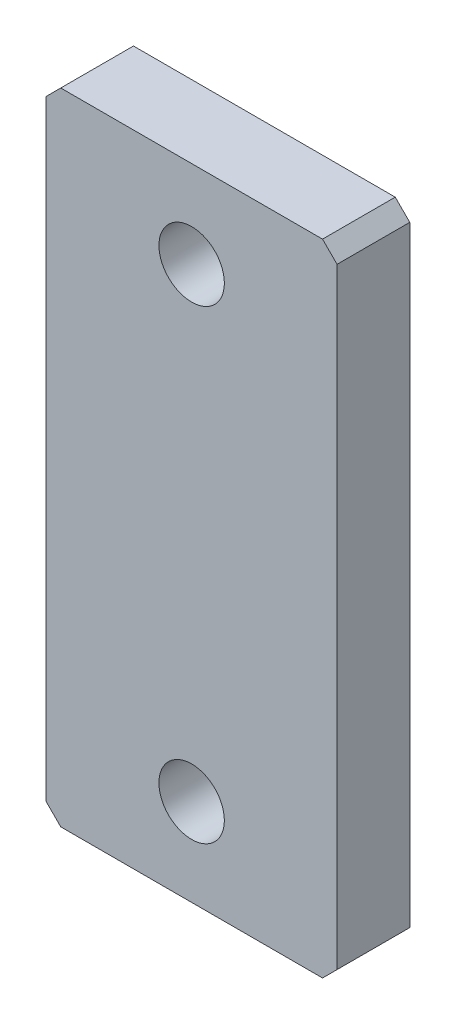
ISO-10303-21;
HEADER;
FILE_DESCRIPTION(('STEP AP214'),'2;1');
FILE_NAME('part.step','',(''),(''),'','','');
FILE_SCHEMA(('AUTOMOTIVE_DESIGN { 1 0 10303 214 1 1 1 1 }'));
ENDSEC;
DATA;
#1=APPLICATION_CONTEXT('core data for automotive mechanical design processes');
#2=APPLICATION_PROTOCOL_DEFINITION('international standard','automotive_design',2000,#1);
#3=PRODUCT_CONTEXT('',#1,'mechanical');
#4=PRODUCT('Part','Part','',(#3));
#5=PRODUCT_RELATED_PRODUCT_CATEGORY('part','',(#4));
#6=PRODUCT_DEFINITION_FORMATION('','',#4);
#7=PRODUCT_DEFINITION_CONTEXT('part definition',#1,'design');
#8=PRODUCT_DEFINITION('design','',#6,#7);
#9=PRODUCT_DEFINITION_SHAPE('','',#8);
#10=(LENGTH_UNIT() NAMED_UNIT(*) SI_UNIT(.MILLI.,.METRE.));
#11=(NAMED_UNIT(*) PLANE_ANGLE_UNIT() SI_UNIT($,.RADIAN.));
#12=(NAMED_UNIT(*) SI_UNIT($,.STERADIAN.) SOLID_ANGLE_UNIT());
#13=UNCERTAINTY_MEASURE_WITH_UNIT(LENGTH_MEASURE(1.E-05),#10,'distance_accuracy_value','');
#14=(GEOMETRIC_REPRESENTATION_CONTEXT(3) GLOBAL_UNCERTAINTY_ASSIGNED_CONTEXT((#13)) GLOBAL_UNIT_ASSIGNED_CONTEXT((#10,
#11,#12)) REPRESENTATION_CONTEXT('',''));
#15=CARTESIAN_POINT('',(0.,0.,0.));
#16=DIRECTION('',(0.,0.,1.));
#17=DIRECTION('',(1.,0.,0.));
#18=AXIS2_PLACEMENT_3D('',#15,#16,#17);
#19=CARTESIAN_POINT('',(0.,0.,5.));
#20=DIRECTION('',(0.,0.,1.));
#21=DIRECTION('',(1.,0.,0.));
#22=AXIS2_PLACEMENT_3D('',#19,#20,#21);
#23=PLANE('',#22);
#24=CARTESIAN_POINT('',(0.,-16.,5.));
#25=DIRECTION('',(0.,0.,1.));
#26=DIRECTION('',(1.,0.,0.));
#27=AXIS2_PLACEMENT_3D('',#24,#25,#26);
#28=CIRCLE('',#27,2.25);
#29=CARTESIAN_POINT('',(2.25,-16.,5.));
#30=VERTEX_POINT('',#29);
#31=EDGE_CURVE('E144',#30,#30,#28,.T.);
#32=ORIENTED_EDGE('',*,*,#31,.F.);
#33=EDGE_LOOP('',(#32));
#34=FACE_BOUND('',#33,.T.);
#35=DIRECTION('',(0.707106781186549,-0.707106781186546,0.));
#36=VECTOR('',#35,1.);
#37=CARTESIAN_POINT('',(-10.,-21.,5.));
#38=LINE('',#37,#36);
#39=CARTESIAN_POINT('',(-10.,-21.,5.));
#40=VERTEX_POINT('',#39);
#41=CARTESIAN_POINT('',(-9.,-22.,5.));
#42=VERTEX_POINT('',#41);
#43=EDGE_CURVE('E155',#40,#42,#38,.T.);
#44=ORIENTED_EDGE('',*,*,#43,.T.);
#45=DIRECTION('',(1.,0.,0.));
#46=VECTOR('',#45,1.);
#47=CARTESIAN_POINT('',(-9.,-22.,5.));
#48=LINE('',#47,#46);
#49=CARTESIAN_POINT('',(9.,-22.,5.));
#50=VERTEX_POINT('',#49);
#51=EDGE_CURVE('E103',#42,#50,#48,.T.);
#52=ORIENTED_EDGE('',*,*,#51,.T.);
#53=DIRECTION('',(0.707106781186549,0.707106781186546,0.));
#54=VECTOR('',#53,1.);
#55=CARTESIAN_POINT('',(9.,-22.,5.));
#56=LINE('',#55,#54);
#57=CARTESIAN_POINT('',(10.,-21.,5.));
#58=VERTEX_POINT('',#57);
#59=EDGE_CURVE('E170',#50,#58,#56,.T.);
#60=ORIENTED_EDGE('',*,*,#59,.T.);
#61=DIRECTION('',(0.,1.,0.));
#62=VECTOR('',#61,1.);
#63=CARTESIAN_POINT('',(10.,-21.,5.));
#64=LINE('',#63,#62);
#65=CARTESIAN_POINT('',(10.,21.,5.));
#66=VERTEX_POINT('',#65);
#67=EDGE_CURVE('E183',#58,#66,#64,.T.);
#68=ORIENTED_EDGE('',*,*,#67,.T.);
#69=DIRECTION('',(-0.707106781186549,0.707106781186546,0.));
#70=VECTOR('',#69,1.);
#71=CARTESIAN_POINT('',(10.,21.,5.));
#72=LINE('',#71,#70);
#73=CARTESIAN_POINT('',(9.,22.,5.));
#74=VERTEX_POINT('',#73);
#75=EDGE_CURVE('E122',#66,#74,#72,.T.);
#76=ORIENTED_EDGE('',*,*,#75,.T.);
#77=DIRECTION('',(-1.,0.,0.));
#78=VECTOR('',#77,1.);
#79=CARTESIAN_POINT('',(9.,22.,5.));
#80=LINE('',#79,#78);
#81=CARTESIAN_POINT('',(-9.,22.,5.));
#82=VERTEX_POINT('',#81);
#83=EDGE_CURVE('E116',#74,#82,#80,.T.);
#84=ORIENTED_EDGE('',*,*,#83,.T.);
#85=DIRECTION('',(-0.707106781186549,-0.707106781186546,0.));
#86=VECTOR('',#85,1.);
#87=CARTESIAN_POINT('',(-9.,22.,5.));
#88=LINE('',#87,#86);
#89=CARTESIAN_POINT('',(-10.,21.,5.));
#90=VERTEX_POINT('',#89);
#91=EDGE_CURVE('E120',#82,#90,#88,.T.);
#92=ORIENTED_EDGE('',*,*,#91,.T.);
#93=DIRECTION('',(0.,-1.,0.));
#94=VECTOR('',#93,1.);
#95=CARTESIAN_POINT('',(-10.,21.,5.));
#96=LINE('',#95,#94);
#97=EDGE_CURVE('E60',#90,#40,#96,.T.);
#98=ORIENTED_EDGE('',*,*,#97,.T.);
#99=EDGE_LOOP('',(#44,#52,#60,#68,#76,#84,#92,#98));
#100=FACE_BOUND('',#99,.T.);
#101=CARTESIAN_POINT('',(0.,16.,5.));
#102=DIRECTION('',(0.,0.,1.));
#103=DIRECTION('',(1.,0.,0.));
#104=AXIS2_PLACEMENT_3D('',#101,#102,#103);
#105=CIRCLE('',#104,2.25);
#106=CARTESIAN_POINT('',(2.25,16.,5.));
#107=VERTEX_POINT('',#106);
#108=EDGE_CURVE('E192',#107,#107,#105,.T.);
#109=ORIENTED_EDGE('',*,*,#108,.F.);
#110=EDGE_LOOP('',(#109));
#111=FACE_BOUND('',#110,.T.);
#112=ADVANCED_FACE('F43',(#34,#100,#111),#23,.T.);
#113=CARTESIAN_POINT('',(0.,0.,0.));
#114=DIRECTION('',(0.,0.,1.));
#115=DIRECTION('',(1.,0.,0.));
#116=AXIS2_PLACEMENT_3D('',#113,#114,#115);
#117=PLANE('',#116);
#118=DIRECTION('',(0.707106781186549,-0.707106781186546,0.));
#119=VECTOR('',#118,1.);
#120=CARTESIAN_POINT('',(-10.,-21.,0.));
#121=LINE('',#120,#119);
#122=CARTESIAN_POINT('',(-10.,-21.,0.));
#123=VERTEX_POINT('',#122);
#124=CARTESIAN_POINT('',(-9.,-22.,0.));
#125=VERTEX_POINT('',#124);
#126=EDGE_CURVE('E140',#123,#125,#121,.T.);
#127=ORIENTED_EDGE('',*,*,#126,.F.);
#128=DIRECTION('',(0.,-1.,0.));
#129=VECTOR('',#128,1.);
#130=CARTESIAN_POINT('',(-10.,21.,0.));
#131=LINE('',#130,#129);
#132=CARTESIAN_POINT('',(-10.,21.,0.));
#133=VERTEX_POINT('',#132);
#134=EDGE_CURVE('E95',#133,#123,#131,.T.);
#135=ORIENTED_EDGE('',*,*,#134,.F.);
#136=DIRECTION('',(-0.707106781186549,-0.707106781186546,0.));
#137=VECTOR('',#136,1.);
#138=CARTESIAN_POINT('',(-9.,22.,0.));
#139=LINE('',#138,#137);
#140=CARTESIAN_POINT('',(-9.,22.,0.));
#141=VERTEX_POINT('',#140);
#142=EDGE_CURVE('E89',#141,#133,#139,.T.);
#143=ORIENTED_EDGE('',*,*,#142,.F.);
#144=DIRECTION('',(-1.,0.,0.));
#145=VECTOR('',#144,1.);
#146=CARTESIAN_POINT('',(9.,22.,0.));
#147=LINE('',#146,#145);
#148=CARTESIAN_POINT('',(9.,22.,0.));
#149=VERTEX_POINT('',#148);
#150=EDGE_CURVE('E130',#149,#141,#147,.T.);
#151=ORIENTED_EDGE('',*,*,#150,.F.);
#152=DIRECTION('',(-0.707106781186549,0.707106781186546,0.));
#153=VECTOR('',#152,1.);
#154=CARTESIAN_POINT('',(10.,21.,0.));
#155=LINE('',#154,#153);
#156=CARTESIAN_POINT('',(10.,21.,0.));
#157=VERTEX_POINT('',#156);
#158=EDGE_CURVE('E150',#157,#149,#155,.T.);
#159=ORIENTED_EDGE('',*,*,#158,.F.);
#160=DIRECTION('',(0.,1.,0.));
#161=VECTOR('',#160,1.);
#162=CARTESIAN_POINT('',(10.,-21.,0.));
#163=LINE('',#162,#161);
#164=CARTESIAN_POINT('',(10.,-21.,0.));
#165=VERTEX_POINT('',#164);
#166=EDGE_CURVE('E148',#165,#157,#163,.T.);
#167=ORIENTED_EDGE('',*,*,#166,.F.);
#168=DIRECTION('',(0.707106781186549,0.707106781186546,0.));
#169=VECTOR('',#168,1.);
#170=CARTESIAN_POINT('',(9.,-22.,0.));
#171=LINE('',#170,#169);
#172=CARTESIAN_POINT('',(9.,-22.,0.));
#173=VERTEX_POINT('',#172);
#174=EDGE_CURVE('E146',#173,#165,#171,.T.);
#175=ORIENTED_EDGE('',*,*,#174,.F.);
#176=DIRECTION('',(1.,0.,0.));
#177=VECTOR('',#176,1.);
#178=CARTESIAN_POINT('',(-9.,-22.,0.));
#179=LINE('',#178,#177);
#180=EDGE_CURVE('E143',#125,#173,#179,.T.);
#181=ORIENTED_EDGE('',*,*,#180,.F.);
#182=EDGE_LOOP('',(#127,#135,#143,#151,#159,#167,#175,#181));
#183=FACE_BOUND('',#182,.T.);
#184=CARTESIAN_POINT('',(0.,-16.,0.));
#185=DIRECTION('',(0.,0.,1.));
#186=DIRECTION('',(1.,0.,0.));
#187=AXIS2_PLACEMENT_3D('',#184,#185,#186);
#188=CIRCLE('',#187,2.25);
#189=CARTESIAN_POINT('',(2.25,-16.,0.));
#190=VERTEX_POINT('',#189);
#191=EDGE_CURVE('E189',#190,#190,#188,.T.);
#192=ORIENTED_EDGE('',*,*,#191,.T.);
#193=EDGE_LOOP('',(#192));
#194=FACE_BOUND('',#193,.T.);
#195=CARTESIAN_POINT('',(0.,16.,0.));
#196=DIRECTION('',(0.,0.,1.));
#197=DIRECTION('',(1.,0.,0.));
#198=AXIS2_PLACEMENT_3D('',#195,#196,#197);
#199=CIRCLE('',#198,2.25);
#200=CARTESIAN_POINT('',(2.25,16.,0.));
#201=VERTEX_POINT('',#200);
#202=EDGE_CURVE('E195',#201,#201,#199,.T.);
#203=ORIENTED_EDGE('',*,*,#202,.T.);
#204=EDGE_LOOP('',(#203));
#205=FACE_BOUND('',#204,.T.);
#206=ADVANCED_FACE('F174',(#183,#194,#205),#117,.F.);
#207=CARTESIAN_POINT('',(-10.,-21.,5.));
#208=DIRECTION('',(0.707106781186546,0.707106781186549,0.));
#209=DIRECTION('',(-0.707106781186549,0.707106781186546,0.));
#210=AXIS2_PLACEMENT_3D('',#207,#208,#209);
#211=PLANE('',#210);
#212=ORIENTED_EDGE('',*,*,#126,.T.);
#213=DIRECTION('',(0.,0.,-1.));
#214=VECTOR('',#213,1.);
#215=CARTESIAN_POINT('',(-9.,-22.,5.));
#216=LINE('',#215,#214);
#217=EDGE_CURVE('E11',#42,#125,#216,.T.);
#218=ORIENTED_EDGE('',*,*,#217,.F.);
#219=ORIENTED_EDGE('',*,*,#43,.F.);
#220=DIRECTION('',(0.,0.,-1.));
#221=VECTOR('',#220,1.);
#222=CARTESIAN_POINT('',(-10.,-21.,5.));
#223=LINE('',#222,#221);
#224=EDGE_CURVE('E136',#40,#123,#223,.T.);
#225=ORIENTED_EDGE('',*,*,#224,.T.);
#226=EDGE_LOOP('',(#212,#218,#219,#225));
#227=FACE_BOUND('',#226,.T.);
#228=ADVANCED_FACE('F45',(#227),#211,.F.);
#229=CARTESIAN_POINT('',(-9.,-22.,5.));
#230=DIRECTION('',(0.,1.,0.));
#231=DIRECTION('',(0.,0.,1.));
#232=AXIS2_PLACEMENT_3D('',#229,#230,#231);
#233=PLANE('',#232);
#234=ORIENTED_EDGE('',*,*,#180,.T.);
#235=DIRECTION('',(0.,0.,-1.));
#236=VECTOR('',#235,1.);
#237=CARTESIAN_POINT('',(9.,-22.,5.));
#238=LINE('',#237,#236);
#239=EDGE_CURVE('E52',#50,#173,#238,.T.);
#240=ORIENTED_EDGE('',*,*,#239,.F.);
#241=ORIENTED_EDGE('',*,*,#51,.F.);
#242=ORIENTED_EDGE('',*,*,#217,.T.);
#243=EDGE_LOOP('',(#234,#240,#241,#242));
#244=FACE_BOUND('',#243,.T.);
#245=ADVANCED_FACE('F227',(#244),#233,.F.);
#246=CARTESIAN_POINT('',(9.,-22.,5.));
#247=DIRECTION('',(-0.707106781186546,0.707106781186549,0.));
#248=DIRECTION('',(-0.707106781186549,-0.707106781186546,0.));
#249=AXIS2_PLACEMENT_3D('',#246,#247,#248);
#250=PLANE('',#249);
#251=ORIENTED_EDGE('',*,*,#174,.T.);
#252=DIRECTION('',(0.,0.,-1.));
#253=VECTOR('',#252,1.);
#254=CARTESIAN_POINT('',(10.,-21.,5.));
#255=LINE('',#254,#253);
#256=EDGE_CURVE('E162',#58,#165,#255,.T.);
#257=ORIENTED_EDGE('',*,*,#256,.F.);
#258=ORIENTED_EDGE('',*,*,#59,.F.);
#259=ORIENTED_EDGE('',*,*,#239,.T.);
#260=EDGE_LOOP('',(#251,#257,#258,#259));
#261=FACE_BOUND('',#260,.T.);
#262=ADVANCED_FACE('F168',(#261),#250,.F.);
#263=CARTESIAN_POINT('',(10.,-21.,5.));
#264=DIRECTION('',(-1.,0.,0.));
#265=DIRECTION('',(0.,0.,1.));
#266=AXIS2_PLACEMENT_3D('',#263,#264,#265);
#267=PLANE('',#266);
#268=ORIENTED_EDGE('',*,*,#166,.T.);
#269=DIRECTION('',(0.,0.,-1.));
#270=VECTOR('',#269,1.);
#271=CARTESIAN_POINT('',(10.,21.,5.));
#272=LINE('',#271,#270);
#273=EDGE_CURVE('E159',#66,#157,#272,.T.);
#274=ORIENTED_EDGE('',*,*,#273,.F.);
#275=ORIENTED_EDGE('',*,*,#67,.F.);
#276=ORIENTED_EDGE('',*,*,#256,.T.);
#277=EDGE_LOOP('',(#268,#274,#275,#276));
#278=FACE_BOUND('',#277,.T.);
#279=ADVANCED_FACE('F179',(#278),#267,.F.);
#280=CARTESIAN_POINT('',(10.,21.,5.));
#281=DIRECTION('',(-0.707106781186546,-0.707106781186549,0.));
#282=DIRECTION('',(0.707106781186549,-0.707106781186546,0.));
#283=AXIS2_PLACEMENT_3D('',#280,#281,#282);
#284=PLANE('',#283);
#285=ORIENTED_EDGE('',*,*,#158,.T.);
#286=DIRECTION('',(0.,0.,-1.));
#287=VECTOR('',#286,1.);
#288=CARTESIAN_POINT('',(9.,22.,5.));
#289=LINE('',#288,#287);
#290=EDGE_CURVE('E131',#74,#149,#289,.T.);
#291=ORIENTED_EDGE('',*,*,#290,.F.);
#292=ORIENTED_EDGE('',*,*,#75,.F.);
#293=ORIENTED_EDGE('',*,*,#273,.T.);
#294=EDGE_LOOP('',(#285,#291,#292,#293));
#295=FACE_BOUND('',#294,.T.);
#296=ADVANCED_FACE('F182',(#295),#284,.F.);
#297=CARTESIAN_POINT('',(9.,22.,5.));
#298=DIRECTION('',(0.,-1.,0.));
#299=DIRECTION('',(0.,0.,-1.));
#300=AXIS2_PLACEMENT_3D('',#297,#298,#299);
#301=PLANE('',#300);
#302=ORIENTED_EDGE('',*,*,#150,.T.);
#303=DIRECTION('',(0.,0.,-1.));
#304=VECTOR('',#303,1.);
#305=CARTESIAN_POINT('',(-9.,22.,5.));
#306=LINE('',#305,#304);
#307=EDGE_CURVE('E127',#82,#141,#306,.T.);
#308=ORIENTED_EDGE('',*,*,#307,.F.);
#309=ORIENTED_EDGE('',*,*,#83,.F.);
#310=ORIENTED_EDGE('',*,*,#290,.T.);
#311=EDGE_LOOP('',(#302,#308,#309,#310));
#312=FACE_BOUND('',#311,.T.);
#313=ADVANCED_FACE('F128',(#312),#301,.F.);
#314=CARTESIAN_POINT('',(-9.,22.,5.));
#315=DIRECTION('',(0.707106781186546,-0.707106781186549,0.));
#316=DIRECTION('',(0.707106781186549,0.707106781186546,0.));
#317=AXIS2_PLACEMENT_3D('',#314,#315,#316);
#318=PLANE('',#317);
#319=ORIENTED_EDGE('',*,*,#142,.T.);
#320=DIRECTION('',(0.,0.,-1.));
#321=VECTOR('',#320,1.);
#322=CARTESIAN_POINT('',(-10.,21.,5.));
#323=LINE('',#322,#321);
#324=EDGE_CURVE('E132',#90,#133,#323,.T.);
#325=ORIENTED_EDGE('',*,*,#324,.F.);
#326=ORIENTED_EDGE('',*,*,#91,.F.);
#327=ORIENTED_EDGE('',*,*,#307,.T.);
#328=EDGE_LOOP('',(#319,#325,#326,#327));
#329=FACE_BOUND('',#328,.T.);
#330=ADVANCED_FACE('F134',(#329),#318,.F.);
#331=CARTESIAN_POINT('',(-10.,21.,5.));
#332=DIRECTION('',(1.,0.,0.));
#333=DIRECTION('',(0.,0.,-1.));
#334=AXIS2_PLACEMENT_3D('',#331,#332,#333);
#335=PLANE('',#334);
#336=ORIENTED_EDGE('',*,*,#134,.T.);
#337=ORIENTED_EDGE('',*,*,#224,.F.);
#338=ORIENTED_EDGE('',*,*,#97,.F.);
#339=ORIENTED_EDGE('',*,*,#324,.T.);
#340=EDGE_LOOP('',(#336,#337,#338,#339));
#341=FACE_BOUND('',#340,.T.);
#342=ADVANCED_FACE('F215',(#341),#335,.F.);
#343=CARTESIAN_POINT('',(0.,-16.,5.));
#344=DIRECTION('',(0.,0.,-1.));
#345=DIRECTION('',(-1.,0.,0.));
#346=AXIS2_PLACEMENT_3D('',#343,#344,#345);
#347=CYLINDRICAL_SURFACE('',#346,2.25);
#348=ORIENTED_EDGE('',*,*,#31,.T.);
#349=EDGE_LOOP('',(#348));
#350=FACE_BOUND('',#349,.T.);
#351=ORIENTED_EDGE('',*,*,#191,.F.);
#352=EDGE_LOOP('',(#351));
#353=FACE_BOUND('',#352,.T.);
#354=ADVANCED_FACE('F212',(#350,#353),#347,.F.);
#355=CARTESIAN_POINT('',(0.,16.,5.));
#356=DIRECTION('',(0.,0.,-1.));
#357=DIRECTION('',(-1.,0.,0.));
#358=AXIS2_PLACEMENT_3D('',#355,#356,#357);
#359=CYLINDRICAL_SURFACE('',#358,2.25);
#360=ORIENTED_EDGE('',*,*,#108,.T.);
#361=EDGE_LOOP('',(#360));
#362=FACE_BOUND('',#361,.T.);
#363=ORIENTED_EDGE('',*,*,#202,.F.);
#364=EDGE_LOOP('',(#363));
#365=FACE_BOUND('',#364,.T.);
#366=ADVANCED_FACE('F201',(#362,#365),#359,.F.);
#367=CLOSED_SHELL('',(#112,#206,#228,#245,#262,#279,#296,#313,#330,#342,#354,#366));
#368=MANIFOLD_SOLID_BREP('B2',#367);
#369=ADVANCED_BREP_SHAPE_REPRESENTATION('',(#18,#368),#14);
#370=SHAPE_DEFINITION_REPRESENTATION(#9,#369);
ENDSEC;
END-ISO-10303-21;
